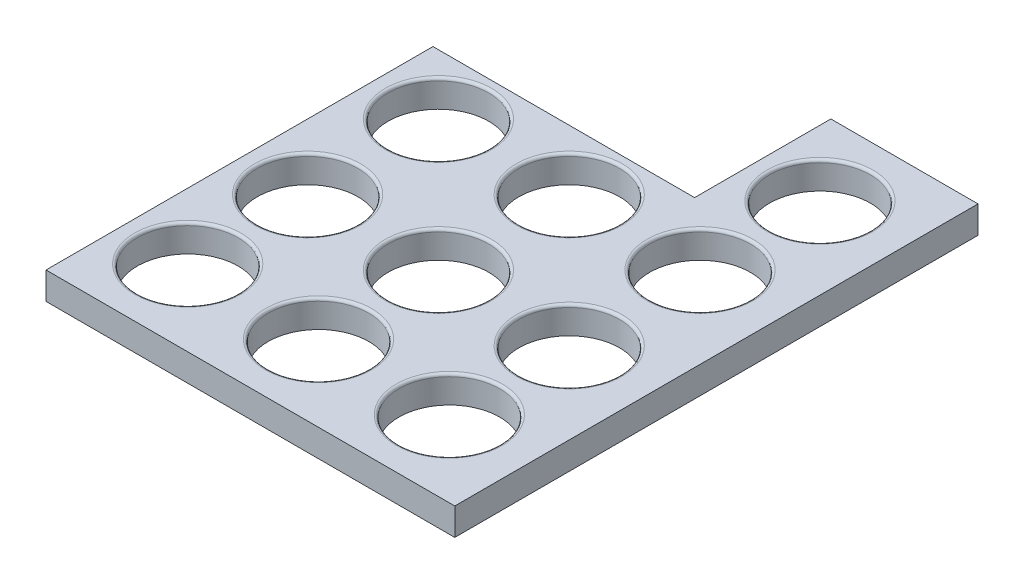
from build123d import *

# Parameters (mm, degrees)
SKETCH1_W           = 126
SKETCH1_H           = 96
SKETCH1_R           = 9.25
BOSS_EXTRUDE1_DEPTH = 5
FILLET1_R           = 0.5
CUT_EXTRUDE1_DEPTH  = 10


with BuildPart() as part:
    # Sketch1 → Boss-Extrude1 (new body)
    with BuildSketch(Plane(origin=(0, 0, 0), x_dir=(1, 0, 0), z_dir=(0, 1, 0))):
        Rectangle(SKETCH1_W, SKETCH1_H)
        with Locations(Location((-48, 34, 0), (0, 0, 270))):
            Circle(SKETCH1_R, mode=Mode.SUBTRACT)
        with Locations(Location((-48, 12, 0), (0, 0, 270))):
            Circle(SKETCH1_R, mode=Mode.SUBTRACT)
        with Locations(Location((-48, -12, 0), (0, 0, 270))):
            Circle(SKETCH1_R, mode=Mode.SUBTRACT)
        with Locations(Location((-48, -34, 0), (0, 0, 270))):
            Circle(SKETCH1_R, mode=Mode.SUBTRACT)
        with Locations(Location((-24, 34, 0), (0, 0, 270))):
            Circle(SKETCH1_R, mode=Mode.SUBTRACT)
        with Locations(Location((-24, 12, 0), (0, 0, 270))):
            Circle(SKETCH1_R, mode=Mode.SUBTRACT)
        with Locations(Location((-24, -12, 0), (0, 0, 270))):
            Circle(SKETCH1_R, mode=Mode.SUBTRACT)
        with Locations(Location((-24, -34, 0), (0, 0, 270))):
            Circle(SKETCH1_R, mode=Mode.SUBTRACT)
        with Locations(Location((48, 34, 0), (0, 0, 270))):
            Circle(SKETCH1_R, mode=Mode.SUBTRACT)
        with Locations(Location((48, 12, 0), (0, 0, 270))):
            Circle(SKETCH1_R, mode=Mode.SUBTRACT)
        with Locations(Location((48, -12, 0), (0, 0, 270))):
            Circle(SKETCH1_R, mode=Mode.SUBTRACT)
        with Locations(Location((48, -34, 0), (0, 0, 270))):
            Circle(SKETCH1_R, mode=Mode.SUBTRACT)
        with Locations(Location((24, 34, 0), (0, 0, 270))):
            Circle(SKETCH1_R, mode=Mode.SUBTRACT)
        with Locations(Location((24, 12, 0), (0, 0, 270))):
            Circle(SKETCH1_R, mode=Mode.SUBTRACT)
        with Locations(Location((24, -12, 0), (0, 0, 270))):
            Circle(SKETCH1_R, mode=Mode.SUBTRACT)
        with Locations(Location((24, -34, 0), (0, 0, 270))):
            Circle(SKETCH1_R, mode=Mode.SUBTRACT)
        with Locations(Location((0, -34, 0), (0, 0, 270))):
            Circle(SKETCH1_R, mode=Mode.SUBTRACT)
        with Locations(Location((0, -12, 0), (0, 0, 270))):
            Circle(SKETCH1_R, mode=Mode.SUBTRACT)
        with Locations(Location((0, 12, 0), (0, 0, 270))):
            Circle(SKETCH1_R, mode=Mode.SUBTRACT)
        with Locations(Location((0, 34, 0), (0, 0, 270))):
            Circle(SKETCH1_R, mode=Mode.SUBTRACT)
    extrude(amount=BOSS_EXTRUDE1_DEPTH)

    # Fillet1
    fillet1_edges = [part.edges().sort_by_distance(p)[0] for p in [
        (24, 5, 2.75),
        (24, 5, 24.75),
        (0, 5, 24.75),
        (0, 5, 2.75),
        (0, 5, -21.25),
        (0, 5, -43.25),
        (-48, 5, -43.25),
        (-48, 5, -21.25),
        (-48, 5, 2.75),
        (-48, 5, 24.75),
        (-24, 5, 2.75),
        (-24, 5, 24.75),
        (48, 5, -43.25),
        (48, 5, -21.25),
        (48, 5, 2.75),
        (48, 5, 24.75),
        (24, 5, -43.25),
        (24, 5, -21.25),
    ]]
    fillet(fillet1_edges, radius=FILLET1_R)

    # Sketch2 → Cut-Extrude1 (cut)
    with BuildSketch(Plane(origin=(0, 5, 0), x_dir=(1, 0, 0), z_dir=(0, 1, 0))):
        Polygon((36, 48), (36, 23), (-12, 23), (-12, -48), (-63, -48), (-63, 48), align=None)
    extrude(amount=-CUT_EXTRUDE1_DEPTH, mode=Mode.SUBTRACT)


solid = part.part
